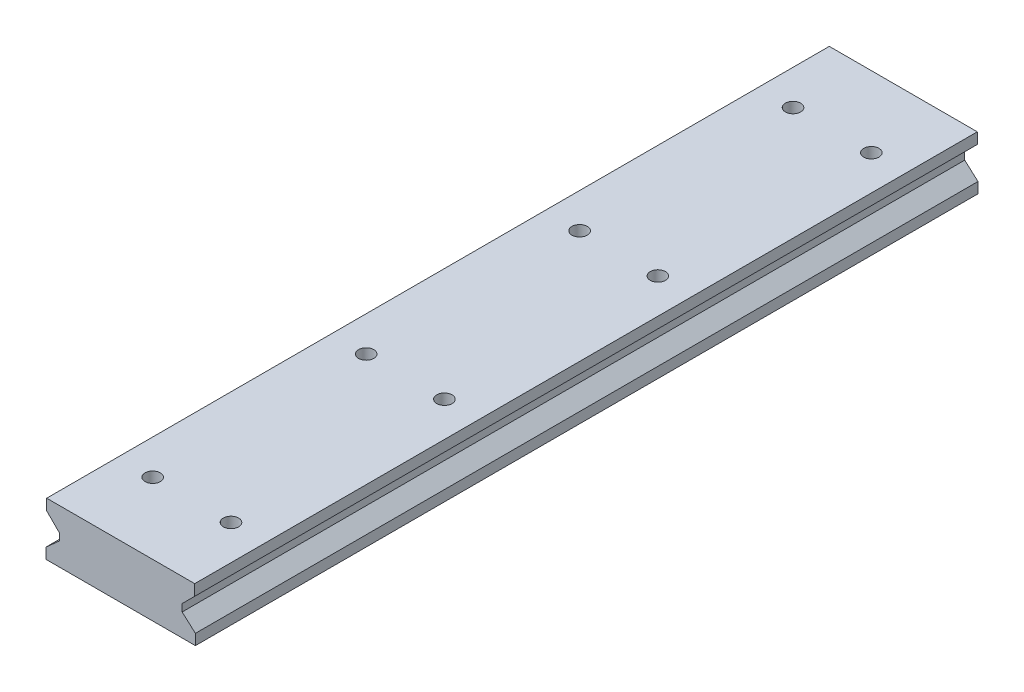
from build123d import *

# Parameters (mm, degrees)
EXTRUSION1_DEPTH           = 220
ESQUISSE3_R                = 2.15
PASSAGE_VIS_DEPTH          = 30
R_P_TITION_LIN_AIRE1_COUNT = 4
R_P_TITION_LIN_AIRE1_PITCH = 60


with BuildPart() as part:
    # Esquisse1 → Extrusion1 (new body)
    with BuildSketch(Plane.XY):
        Polygon((21, 0), (-21, 0), (-21, 3), (-17.268926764, 6.328527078), (-17.268926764, 8.381896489), (-20.80446067, 11.917430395), (-20.80446067, 15), (20.80446067, 15), (20.80446067, 11.917430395), (17.268926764, 8.381896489), (17.268926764, 6.328527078), (21, 3), align=None)
    extrude(amount=EXTRUSION1_DEPTH)

    # Esquisse3 → passage vis (cut)
    with BuildSketch(Plane.XZ):
        with Locations(Location((-11, 200, 0), (0, 0, 270))):
            Circle(ESQUISSE3_R)
        with Locations(Location((11, 200, 0), (0, 0, 270))):
            Circle(ESQUISSE3_R)
    passage_vis = extrude(amount=-PASSAGE_VIS_DEPTH, mode=Mode.SUBTRACT)

    # R_p_tition lin_aire1: passage vis ×4
    with Locations(*[(0, 0, -i * R_P_TITION_LIN_AIRE1_PITCH) for i in range(1, R_P_TITION_LIN_AIRE1_COUNT)]):
        add(passage_vis, mode=Mode.SUBTRACT)


solid = part.part
